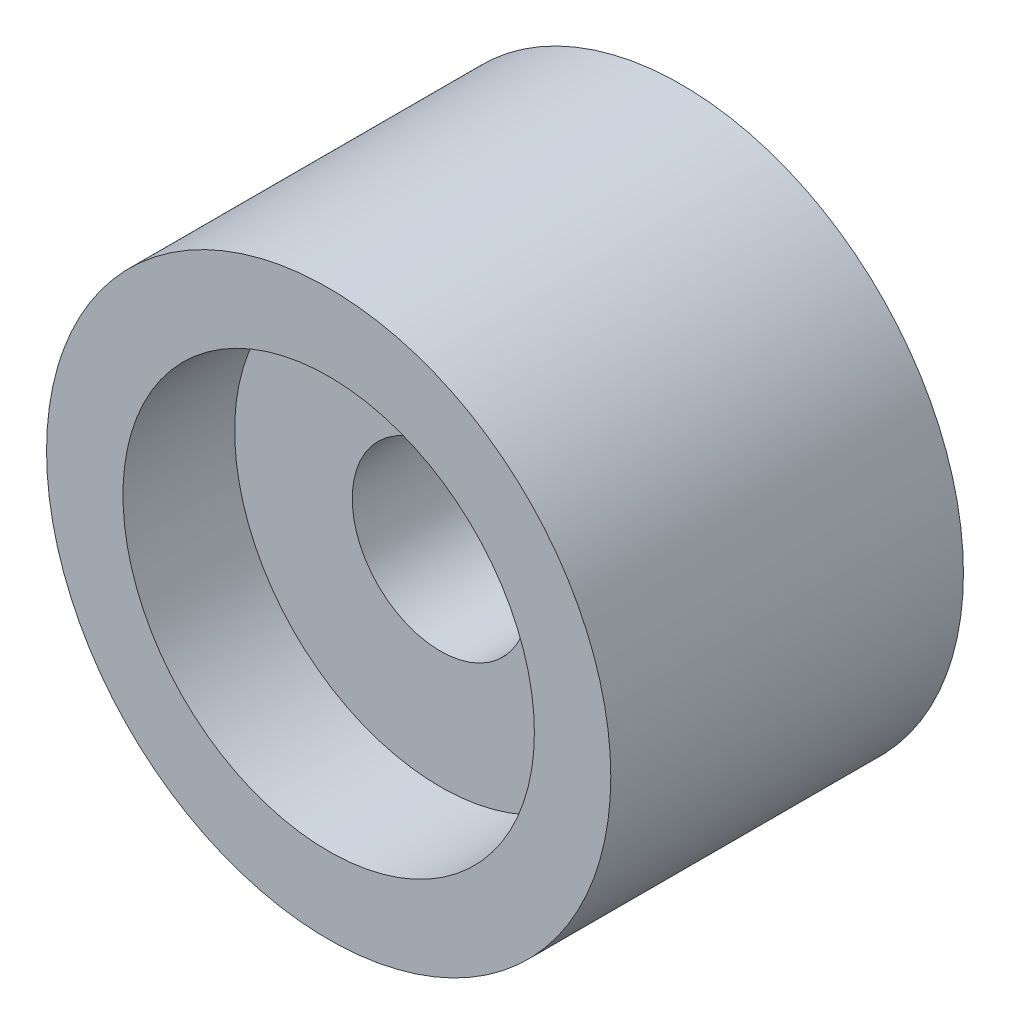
ISO-10303-21;
HEADER;
FILE_DESCRIPTION(('STEP AP214'),'2;1');
FILE_NAME('part.step','',(''),(''),'','','');
FILE_SCHEMA(('AUTOMOTIVE_DESIGN { 1 0 10303 214 1 1 1 1 }'));
ENDSEC;
DATA;
#1=APPLICATION_CONTEXT('core data for automotive mechanical design processes');
#2=APPLICATION_PROTOCOL_DEFINITION('international standard','automotive_design',2000,#1);
#3=PRODUCT_CONTEXT('',#1,'mechanical');
#4=PRODUCT('Part','Part','',(#3));
#5=PRODUCT_RELATED_PRODUCT_CATEGORY('part','',(#4));
#6=PRODUCT_DEFINITION_FORMATION('','',#4);
#7=PRODUCT_DEFINITION_CONTEXT('part definition',#1,'design');
#8=PRODUCT_DEFINITION('design','',#6,#7);
#9=PRODUCT_DEFINITION_SHAPE('','',#8);
#10=(LENGTH_UNIT() NAMED_UNIT(*) SI_UNIT(.MILLI.,.METRE.));
#11=(NAMED_UNIT(*) PLANE_ANGLE_UNIT() SI_UNIT($,.RADIAN.));
#12=(NAMED_UNIT(*) SI_UNIT($,.STERADIAN.) SOLID_ANGLE_UNIT());
#13=UNCERTAINTY_MEASURE_WITH_UNIT(LENGTH_MEASURE(1.E-05),#10,'distance_accuracy_value','');
#14=(GEOMETRIC_REPRESENTATION_CONTEXT(3) GLOBAL_UNCERTAINTY_ASSIGNED_CONTEXT((#13)) GLOBAL_UNIT_ASSIGNED_CONTEXT((#10,
#11,#12)) REPRESENTATION_CONTEXT('',''));
#15=CARTESIAN_POINT('',(0.,0.,0.));
#16=DIRECTION('',(0.,0.,1.));
#17=DIRECTION('',(1.,0.,0.));
#18=AXIS2_PLACEMENT_3D('',#15,#16,#17);
#19=CARTESIAN_POINT('',(0.,22.,-15.));
#20=DIRECTION('',(0.,0.,1.));
#21=DIRECTION('',(1.,0.,0.));
#22=AXIS2_PLACEMENT_3D('',#19,#20,#21);
#23=PLANE('',#22);
#24=CARTESIAN_POINT('',(0.,0.,-15.));
#25=DIRECTION('',(0.,0.,-1.));
#26=DIRECTION('',(-1.,0.,0.));
#27=AXIS2_PLACEMENT_3D('',#24,#25,#26);
#28=CIRCLE('',#27,14.);
#29=CARTESIAN_POINT('',(-14.,0.,-15.));
#30=VERTEX_POINT('',#29);
#31=EDGE_CURVE('E26',#30,#30,#28,.T.);
#32=ORIENTED_EDGE('',*,*,#31,.F.);
#33=EDGE_LOOP('',(#32));
#34=FACE_BOUND('',#33,.T.);
#35=CARTESIAN_POINT('',(0.,0.,-15.));
#36=DIRECTION('',(0.,0.,1.));
#37=DIRECTION('',(1.,0.,0.));
#38=AXIS2_PLACEMENT_3D('',#35,#36,#37);
#39=CIRCLE('',#38,24.);
#40=CARTESIAN_POINT('',(24.,0.,-15.));
#41=VERTEX_POINT('',#40);
#42=EDGE_CURVE('E37',#41,#41,#39,.T.);
#43=ORIENTED_EDGE('',*,*,#42,.F.);
#44=EDGE_LOOP('',(#43));
#45=FACE_BOUND('',#44,.T.);
#46=ADVANCED_FACE('F12',(#34,#45),#23,.F.);
#47=CARTESIAN_POINT('',(0.,30.,15.));
#48=DIRECTION('',(0.,0.,-1.));
#49=DIRECTION('',(-1.,0.,0.));
#50=AXIS2_PLACEMENT_3D('',#47,#48,#49);
#51=PLANE('',#50);
#52=CARTESIAN_POINT('',(0.,0.,15.));
#53=DIRECTION('',(0.,0.,1.));
#54=DIRECTION('',(1.,0.,0.));
#55=AXIS2_PLACEMENT_3D('',#52,#53,#54);
#56=CIRCLE('',#55,17.5);
#57=CARTESIAN_POINT('',(17.5,0.,15.));
#58=VERTEX_POINT('',#57);
#59=EDGE_CURVE('E31',#58,#58,#56,.T.);
#60=ORIENTED_EDGE('',*,*,#59,.F.);
#61=EDGE_LOOP('',(#60));
#62=FACE_BOUND('',#61,.T.);
#63=CARTESIAN_POINT('',(0.,0.,15.));
#64=DIRECTION('',(0.,0.,1.));
#65=DIRECTION('',(1.,0.,0.));
#66=AXIS2_PLACEMENT_3D('',#63,#64,#65);
#67=CIRCLE('',#66,24.);
#68=CARTESIAN_POINT('',(24.,0.,15.));
#69=VERTEX_POINT('',#68);
#70=EDGE_CURVE('E38',#69,#69,#67,.T.);
#71=ORIENTED_EDGE('',*,*,#70,.T.);
#72=EDGE_LOOP('',(#71));
#73=FACE_BOUND('',#72,.T.);
#74=ADVANCED_FACE('F48',(#62,#73),#51,.F.);
#75=CARTESIAN_POINT('',(0.,16.,-5.5));
#76=DIRECTION('',(0.,0.,1.));
#77=DIRECTION('',(1.,0.,0.));
#78=AXIS2_PLACEMENT_3D('',#75,#76,#77);
#79=PLANE('',#78);
#80=CARTESIAN_POINT('',(0.,0.,-5.5));
#81=DIRECTION('',(0.,0.,1.));
#82=DIRECTION('',(1.,0.,0.));
#83=AXIS2_PLACEMENT_3D('',#80,#81,#82);
#84=CIRCLE('',#83,7.5);
#85=CARTESIAN_POINT('',(7.5,0.,-5.5));
#86=VERTEX_POINT('',#85);
#87=EDGE_CURVE('E22',#86,#86,#84,.T.);
#88=ORIENTED_EDGE('',*,*,#87,.T.);
#89=EDGE_LOOP('',(#88));
#90=FACE_BOUND('',#89,.T.);
#91=CARTESIAN_POINT('',(0.,0.,-5.5));
#92=DIRECTION('',(0.,0.,1.));
#93=DIRECTION('',(1.,0.,0.));
#94=AXIS2_PLACEMENT_3D('',#91,#92,#93);
#95=CIRCLE('',#94,14.);
#96=CARTESIAN_POINT('',(14.,0.,-5.5));
#97=VERTEX_POINT('',#96);
#98=EDGE_CURVE('E8',#97,#97,#95,.T.);
#99=ORIENTED_EDGE('',*,*,#98,.F.);
#100=EDGE_LOOP('',(#99));
#101=FACE_BOUND('',#100,.T.);
#102=ADVANCED_FACE('F55',(#90,#101),#79,.F.);
#103=CARTESIAN_POINT('',(0.,7.5,5.5));
#104=DIRECTION('',(0.,0.,-1.));
#105=DIRECTION('',(-1.,0.,0.));
#106=AXIS2_PLACEMENT_3D('',#103,#104,#105);
#107=PLANE('',#106);
#108=CARTESIAN_POINT('',(0.,0.,5.5));
#109=DIRECTION('',(0.,0.,1.));
#110=DIRECTION('',(1.,0.,0.));
#111=AXIS2_PLACEMENT_3D('',#108,#109,#110);
#112=CIRCLE('',#111,7.5);
#113=CARTESIAN_POINT('',(7.5,0.,5.5));
#114=VERTEX_POINT('',#113);
#115=EDGE_CURVE('E18',#114,#114,#112,.T.);
#116=ORIENTED_EDGE('',*,*,#115,.F.);
#117=EDGE_LOOP('',(#116));
#118=FACE_BOUND('',#117,.T.);
#119=CARTESIAN_POINT('',(0.,0.,5.5));
#120=DIRECTION('',(0.,0.,1.));
#121=DIRECTION('',(1.,0.,0.));
#122=AXIS2_PLACEMENT_3D('',#119,#120,#121);
#123=CIRCLE('',#122,17.5);
#124=CARTESIAN_POINT('',(17.5,0.,5.5));
#125=VERTEX_POINT('',#124);
#126=EDGE_CURVE('E34',#125,#125,#123,.T.);
#127=ORIENTED_EDGE('',*,*,#126,.T.);
#128=EDGE_LOOP('',(#127));
#129=FACE_BOUND('',#128,.T.);
#130=ADVANCED_FACE('F71',(#118,#129),#107,.F.);
#131=CARTESIAN_POINT('',(0.,0.,16.6183293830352));
#132=DIRECTION('',(0.,0.,1.));
#133=DIRECTION('',(1.,0.,0.));
#134=AXIS2_PLACEMENT_3D('',#131,#132,#133);
#135=CYLINDRICAL_SURFACE('',#134,7.5);
#136=ORIENTED_EDGE('',*,*,#87,.F.);
#137=EDGE_LOOP('',(#136));
#138=FACE_BOUND('',#137,.T.);
#139=ORIENTED_EDGE('',*,*,#115,.T.);
#140=EDGE_LOOP('',(#139));
#141=FACE_BOUND('',#140,.T.);
#142=ADVANCED_FACE('F62',(#138,#141),#135,.F.);
#143=CARTESIAN_POINT('',(0.,0.,-5.5));
#144=DIRECTION('',(0.,0.,-1.));
#145=DIRECTION('',(-1.,0.,0.));
#146=AXIS2_PLACEMENT_3D('',#143,#144,#145);
#147=CYLINDRICAL_SURFACE('',#146,14.);
#148=ORIENTED_EDGE('',*,*,#98,.T.);
#149=EDGE_LOOP('',(#148));
#150=FACE_BOUND('',#149,.T.);
#151=ORIENTED_EDGE('',*,*,#31,.T.);
#152=EDGE_LOOP('',(#151));
#153=FACE_BOUND('',#152,.T.);
#154=ADVANCED_FACE('F59',(#150,#153),#147,.F.);
#155=CARTESIAN_POINT('',(0.,0.,5.5));
#156=DIRECTION('',(0.,0.,1.));
#157=DIRECTION('',(1.,0.,0.));
#158=AXIS2_PLACEMENT_3D('',#155,#156,#157);
#159=CYLINDRICAL_SURFACE('',#158,17.5);
#160=ORIENTED_EDGE('',*,*,#59,.T.);
#161=EDGE_LOOP('',(#160));
#162=FACE_BOUND('',#161,.T.);
#163=ORIENTED_EDGE('',*,*,#126,.F.);
#164=EDGE_LOOP('',(#163));
#165=FACE_BOUND('',#164,.T.);
#166=ADVANCED_FACE('F61',(#162,#165),#159,.F.);
#167=CARTESIAN_POINT('',(0.,0.,-15.));
#168=DIRECTION('',(0.,0.,1.));
#169=DIRECTION('',(1.,0.,0.));
#170=AXIS2_PLACEMENT_3D('',#167,#168,#169);
#171=CYLINDRICAL_SURFACE('',#170,24.);
#172=ORIENTED_EDGE('',*,*,#42,.T.);
#173=EDGE_LOOP('',(#172));
#174=FACE_BOUND('',#173,.T.);
#175=ORIENTED_EDGE('',*,*,#70,.F.);
#176=EDGE_LOOP('',(#175));
#177=FACE_BOUND('',#176,.T.);
#178=ADVANCED_FACE('F44',(#174,#177),#171,.T.);
#179=CLOSED_SHELL('',(#46,#74,#102,#130,#142,#154,#166,#178));
#180=MANIFOLD_SOLID_BREP('B1',#179);
#181=ADVANCED_BREP_SHAPE_REPRESENTATION('',(#18,#180),#14);
#182=SHAPE_DEFINITION_REPRESENTATION(#9,#181);
ENDSEC;
END-ISO-10303-21;
